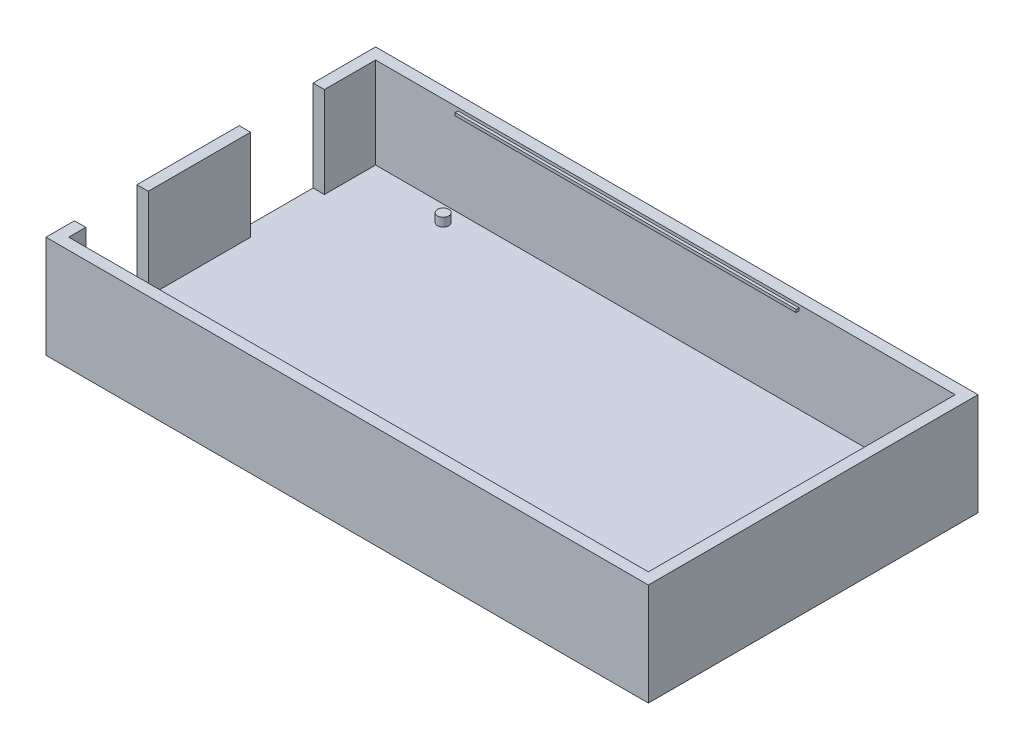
ISO-10303-21;
HEADER;
FILE_DESCRIPTION(('STEP AP214'),'2;1');
FILE_NAME('part.step','',(''),(''),'','','');
FILE_SCHEMA(('AUTOMOTIVE_DESIGN { 1 0 10303 214 1 1 1 1 }'));
ENDSEC;
DATA;
#1=APPLICATION_CONTEXT('core data for automotive mechanical design processes');
#2=APPLICATION_PROTOCOL_DEFINITION('international standard','automotive_design',2000,#1);
#3=PRODUCT_CONTEXT('',#1,'mechanical');
#4=PRODUCT('Part','Part','',(#3));
#5=PRODUCT_RELATED_PRODUCT_CATEGORY('part','',(#4));
#6=PRODUCT_DEFINITION_FORMATION('','',#4);
#7=PRODUCT_DEFINITION_CONTEXT('part definition',#1,'design');
#8=PRODUCT_DEFINITION('design','',#6,#7);
#9=PRODUCT_DEFINITION_SHAPE('','',#8);
#10=(LENGTH_UNIT() NAMED_UNIT(*) SI_UNIT(.MILLI.,.METRE.));
#11=(NAMED_UNIT(*) PLANE_ANGLE_UNIT() SI_UNIT($,.RADIAN.));
#12=(NAMED_UNIT(*) SI_UNIT($,.STERADIAN.) SOLID_ANGLE_UNIT());
#13=UNCERTAINTY_MEASURE_WITH_UNIT(LENGTH_MEASURE(1.E-05),#10,'distance_accuracy_value','');
#14=(GEOMETRIC_REPRESENTATION_CONTEXT(3) GLOBAL_UNCERTAINTY_ASSIGNED_CONTEXT((#13)) GLOBAL_UNIT_ASSIGNED_CONTEXT((#10,
#11,#12)) REPRESENTATION_CONTEXT('',''));
#15=CARTESIAN_POINT('',(0.,0.,0.));
#16=DIRECTION('',(0.,0.,1.));
#17=DIRECTION('',(1.,0.,0.));
#18=AXIS2_PLACEMENT_3D('',#15,#16,#17);
#19=CARTESIAN_POINT('',(0.,18.,-2.));
#20=DIRECTION('',(0.,0.,-1.));
#21=DIRECTION('',(-1.,0.,0.));
#22=AXIS2_PLACEMENT_3D('',#19,#20,#21);
#23=PLANE('',#22);
#24=DIRECTION('',(1.,0.,0.));
#25=VECTOR('',#24,1.);
#26=CARTESIAN_POINT('',(0.,2.,-2.));
#27=LINE('',#26,#25);
#28=CARTESIAN_POINT('',(2.,2.,-2.));
#29=VERTEX_POINT('',#28);
#30=CARTESIAN_POINT('',(104.,2.,-2.));
#31=VERTEX_POINT('',#30);
#32=EDGE_CURVE('E301',#29,#31,#27,.T.);
#33=ORIENTED_EDGE('',*,*,#32,.F.);
#34=DIRECTION('',(0.,-1.,0.));
#35=VECTOR('',#34,1.);
#36=CARTESIAN_POINT('',(2.,18.,-2.));
#37=LINE('',#36,#35);
#38=CARTESIAN_POINT('',(2.,18.,-2.));
#39=VERTEX_POINT('',#38);
#40=EDGE_CURVE('E303',#39,#29,#37,.T.);
#41=ORIENTED_EDGE('',*,*,#40,.F.);
#42=DIRECTION('',(1.,0.,0.));
#43=VECTOR('',#42,1.);
#44=CARTESIAN_POINT('',(0.,18.,-2.));
#45=LINE('',#44,#43);
#46=CARTESIAN_POINT('',(104.,18.,-2.));
#47=VERTEX_POINT('',#46);
#48=EDGE_CURVE('E326',#39,#47,#45,.T.);
#49=ORIENTED_EDGE('',*,*,#48,.T.);
#50=DIRECTION('',(0.,-1.,0.));
#51=VECTOR('',#50,1.);
#52=CARTESIAN_POINT('',(104.,18.,-2.));
#53=LINE('',#52,#51);
#54=EDGE_CURVE('E307',#47,#31,#53,.T.);
#55=ORIENTED_EDGE('',*,*,#54,.T.);
#56=EDGE_LOOP('',(#33,#41,#49,#55));
#57=FACE_BOUND('',#56,.T.);
#58=DIRECTION('',(-1.,0.,0.));
#59=VECTOR('',#58,1.);
#60=CARTESIAN_POINT('',(89.5,17.,-2.));
#61=LINE('',#60,#59);
#62=CARTESIAN_POINT('',(89.5,17.,-2.));
#63=VERTEX_POINT('',#62);
#64=CARTESIAN_POINT('',(29.5,17.,-2.));
#65=VERTEX_POINT('',#64);
#66=EDGE_CURVE('E788',#63,#65,#61,.T.);
#67=ORIENTED_EDGE('',*,*,#66,.F.);
#68=DIRECTION('',(0.,-1.,0.));
#69=VECTOR('',#68,1.);
#70=CARTESIAN_POINT('',(89.5,17.5,-2.));
#71=LINE('',#70,#69);
#72=CARTESIAN_POINT('',(89.5,17.5,-2.));
#73=VERTEX_POINT('',#72);
#74=EDGE_CURVE('E218',#73,#63,#71,.T.);
#75=ORIENTED_EDGE('',*,*,#74,.F.);
#76=DIRECTION('',(1.,0.,0.));
#77=VECTOR('',#76,1.);
#78=CARTESIAN_POINT('',(89.5,17.5,-2.));
#79=LINE('',#78,#77);
#80=CARTESIAN_POINT('',(29.5,17.5,-2.));
#81=VERTEX_POINT('',#80);
#82=EDGE_CURVE('E214',#81,#73,#79,.T.);
#83=ORIENTED_EDGE('',*,*,#82,.F.);
#84=DIRECTION('',(0.,1.,0.));
#85=VECTOR('',#84,1.);
#86=CARTESIAN_POINT('',(29.5,17.5,-2.));
#87=LINE('',#86,#85);
#88=EDGE_CURVE('E790',#65,#81,#87,.T.);
#89=ORIENTED_EDGE('',*,*,#88,.F.);
#90=EDGE_LOOP('',(#67,#75,#83,#89));
#91=FACE_BOUND('',#90,.T.);
#92=ADVANCED_FACE('F33',(#57,#91),#23,.T.);
#93=CARTESIAN_POINT('',(0.,18.,-56.));
#94=DIRECTION('',(0.,0.,1.));
#95=DIRECTION('',(1.,0.,0.));
#96=AXIS2_PLACEMENT_3D('',#93,#94,#95);
#97=PLANE('',#96);
#98=DIRECTION('',(-1.,0.,0.));
#99=VECTOR('',#98,1.);
#100=CARTESIAN_POINT('',(0.,2.,-56.));
#101=LINE('',#100,#99);
#102=CARTESIAN_POINT('',(104.,2.,-56.));
#103=VERTEX_POINT('',#102);
#104=CARTESIAN_POINT('',(2.,2.,-56.));
#105=VERTEX_POINT('',#104);
#106=EDGE_CURVE('E318',#103,#105,#101,.T.);
#107=ORIENTED_EDGE('',*,*,#106,.F.);
#108=DIRECTION('',(0.,-1.,0.));
#109=VECTOR('',#108,1.);
#110=CARTESIAN_POINT('',(104.,18.,-56.));
#111=LINE('',#110,#109);
#112=CARTESIAN_POINT('',(104.,18.,-56.));
#113=VERTEX_POINT('',#112);
#114=EDGE_CURVE('E311',#113,#103,#111,.T.);
#115=ORIENTED_EDGE('',*,*,#114,.F.);
#116=DIRECTION('',(-1.,0.,0.));
#117=VECTOR('',#116,1.);
#118=CARTESIAN_POINT('',(0.,18.,-56.));
#119=LINE('',#118,#117);
#120=CARTESIAN_POINT('',(2.,18.,-56.));
#121=VERTEX_POINT('',#120);
#122=EDGE_CURVE('E312',#113,#121,#119,.T.);
#123=ORIENTED_EDGE('',*,*,#122,.T.);
#124=DIRECTION('',(0.,-1.,0.));
#125=VECTOR('',#124,1.);
#126=CARTESIAN_POINT('',(2.,18.,-56.));
#127=LINE('',#126,#125);
#128=EDGE_CURVE('E308',#121,#105,#127,.T.);
#129=ORIENTED_EDGE('',*,*,#128,.T.);
#130=EDGE_LOOP('',(#107,#115,#123,#129));
#131=FACE_BOUND('',#130,.T.);
#132=DIRECTION('',(1.,0.,0.));
#133=VECTOR('',#132,1.);
#134=CARTESIAN_POINT('',(16.5,17.,-56.));
#135=LINE('',#134,#133);
#136=CARTESIAN_POINT('',(16.5,17.,-56.));
#137=VERTEX_POINT('',#136);
#138=CARTESIAN_POINT('',(76.5,17.,-56.));
#139=VERTEX_POINT('',#138);
#140=EDGE_CURVE('E223',#137,#139,#135,.T.);
#141=ORIENTED_EDGE('',*,*,#140,.F.);
#142=DIRECTION('',(0.,-1.,0.));
#143=VECTOR('',#142,1.);
#144=CARTESIAN_POINT('',(16.5,17.5,-56.));
#145=LINE('',#144,#143);
#146=CARTESIAN_POINT('',(16.5,17.5,-56.));
#147=VERTEX_POINT('',#146);
#148=EDGE_CURVE('E220',#147,#137,#145,.T.);
#149=ORIENTED_EDGE('',*,*,#148,.F.);
#150=DIRECTION('',(-1.,0.,0.));
#151=VECTOR('',#150,1.);
#152=CARTESIAN_POINT('',(16.5,17.5,-56.));
#153=LINE('',#152,#151);
#154=CARTESIAN_POINT('',(76.5,17.5,-56.));
#155=VERTEX_POINT('',#154);
#156=EDGE_CURVE('E232',#155,#147,#153,.T.);
#157=ORIENTED_EDGE('',*,*,#156,.F.);
#158=DIRECTION('',(0.,1.,0.));
#159=VECTOR('',#158,1.);
#160=CARTESIAN_POINT('',(76.5,17.5,-56.));
#161=LINE('',#160,#159);
#162=EDGE_CURVE('E240',#139,#155,#161,.T.);
#163=ORIENTED_EDGE('',*,*,#162,.F.);
#164=EDGE_LOOP('',(#141,#149,#157,#163));
#165=FACE_BOUND('',#164,.T.);
#166=ADVANCED_FACE('F462',(#131,#165),#97,.T.);
#167=CARTESIAN_POINT('',(2.,18.,0.));
#168=DIRECTION('',(1.,0.,0.));
#169=DIRECTION('',(0.,0.,-1.));
#170=AXIS2_PLACEMENT_3D('',#167,#168,#169);
#171=PLANE('',#170);
#172=DIRECTION('',(0.,1.,0.));
#173=VECTOR('',#172,1.);
#174=CARTESIAN_POINT('',(2.,2.,-5.));
#175=LINE('',#174,#173);
#176=CARTESIAN_POINT('',(2.,2.,-5.));
#177=VERTEX_POINT('',#176);
#178=CARTESIAN_POINT('',(2.,18.,-5.));
#179=VERTEX_POINT('',#178);
#180=EDGE_CURVE('E266',#177,#179,#175,.T.);
#181=ORIENTED_EDGE('',*,*,#180,.T.);
#182=DIRECTION('',(0.,0.,1.));
#183=VECTOR('',#182,1.);
#184=CARTESIAN_POINT('',(2.,18.,0.));
#185=LINE('',#184,#183);
#186=EDGE_CURVE('E322',#179,#39,#185,.T.);
#187=ORIENTED_EDGE('',*,*,#186,.T.);
#188=ORIENTED_EDGE('',*,*,#40,.T.);
#189=DIRECTION('',(0.,0.,1.));
#190=VECTOR('',#189,1.);
#191=CARTESIAN_POINT('',(2.,2.,0.));
#192=LINE('',#191,#190);
#193=EDGE_CURVE('E282',#177,#29,#192,.T.);
#194=ORIENTED_EDGE('',*,*,#193,.F.);
#195=EDGE_LOOP('',(#181,#187,#188,#194));
#196=FACE_BOUND('',#195,.T.);
#197=ADVANCED_FACE('F426',(#196),#171,.T.);
#198=CARTESIAN_POINT('',(0.,18.,0.));
#199=DIRECTION('',(0.,-1.,0.));
#200=DIRECTION('',(0.,0.,-1.));
#201=AXIS2_PLACEMENT_3D('',#198,#199,#200);
#202=PLANE('',#201);
#203=ORIENTED_EDGE('',*,*,#186,.F.);
#204=DIRECTION('',(-1.,0.,0.));
#205=VECTOR('',#204,1.);
#206=CARTESIAN_POINT('',(106.001,18.,-5.));
#207=LINE('',#206,#205);
#208=CARTESIAN_POINT('',(0.,18.,-5.));
#209=VERTEX_POINT('',#208);
#210=EDGE_CURVE('E269',#179,#209,#207,.T.);
#211=ORIENTED_EDGE('',*,*,#210,.T.);
#212=DIRECTION('',(0.,0.,1.));
#213=VECTOR('',#212,1.);
#214=CARTESIAN_POINT('',(0.,18.,0.));
#215=LINE('',#214,#213);
#216=CARTESIAN_POINT('',(0.,18.,0.));
#217=VERTEX_POINT('',#216);
#218=EDGE_CURVE('E338',#209,#217,#215,.T.);
#219=ORIENTED_EDGE('',*,*,#218,.T.);
#220=DIRECTION('',(1.,0.,0.));
#221=VECTOR('',#220,1.);
#222=CARTESIAN_POINT('',(0.,18.,0.));
#223=LINE('',#222,#221);
#224=CARTESIAN_POINT('',(106.,18.,0.));
#225=VERTEX_POINT('',#224);
#226=EDGE_CURVE('E336',#217,#225,#223,.T.);
#227=ORIENTED_EDGE('',*,*,#226,.T.);
#228=DIRECTION('',(0.,0.,-1.));
#229=VECTOR('',#228,1.);
#230=CARTESIAN_POINT('',(106.,18.,0.));
#231=LINE('',#230,#229);
#232=CARTESIAN_POINT('',(106.,18.,-58.));
#233=VERTEX_POINT('',#232);
#234=EDGE_CURVE('E340',#225,#233,#231,.T.);
#235=ORIENTED_EDGE('',*,*,#234,.T.);
#236=DIRECTION('',(-1.,0.,0.));
#237=VECTOR('',#236,1.);
#238=CARTESIAN_POINT('',(0.,18.,-58.));
#239=LINE('',#238,#237);
#240=CARTESIAN_POINT('',(0.,18.,-58.));
#241=VERTEX_POINT('',#240);
#242=EDGE_CURVE('E342',#233,#241,#239,.T.);
#243=ORIENTED_EDGE('',*,*,#242,.T.);
#244=CARTESIAN_POINT('',(0.,18.,-47.));
#245=VERTEX_POINT('',#244);
#246=EDGE_CURVE('E333',#241,#245,#215,.T.);
#247=ORIENTED_EDGE('',*,*,#246,.T.);
#248=DIRECTION('',(-1.,0.,0.));
#249=VECTOR('',#248,1.);
#250=CARTESIAN_POINT('',(106.001,18.,-47.));
#251=LINE('',#250,#249);
#252=CARTESIAN_POINT('',(2.,18.,-47.));
#253=VERTEX_POINT('',#252);
#254=EDGE_CURVE('E259',#253,#245,#251,.T.);
#255=ORIENTED_EDGE('',*,*,#254,.F.);
#256=EDGE_CURVE('E323',#121,#253,#185,.T.);
#257=ORIENTED_EDGE('',*,*,#256,.F.);
#258=ORIENTED_EDGE('',*,*,#122,.F.);
#259=DIRECTION('',(0.,0.,-1.));
#260=VECTOR('',#259,1.);
#261=CARTESIAN_POINT('',(104.,18.,0.));
#262=LINE('',#261,#260);
#263=EDGE_CURVE('E329',#47,#113,#262,.T.);
#264=ORIENTED_EDGE('',*,*,#263,.F.);
#265=ORIENTED_EDGE('',*,*,#48,.F.);
#266=EDGE_LOOP('',(#203,#211,#219,#227,#235,#243,#247,#255,#257,#258,#264,#265));
#267=FACE_BOUND('',#266,.T.);
#268=ADVANCED_FACE('F397',(#267),#202,.F.);
#269=DIRECTION('',(0.,-1.,0.));
#270=VECTOR('',#269,1.);
#271=CARTESIAN_POINT('',(2.,18.,-16.));
#272=LINE('',#271,#270);
#273=CARTESIAN_POINT('',(2.,18.,-16.));
#274=VERTEX_POINT('',#273);
#275=CARTESIAN_POINT('',(2.,2.,-16.));
#276=VERTEX_POINT('',#275);
#277=EDGE_CURVE('E252',#274,#276,#272,.T.);
#278=ORIENTED_EDGE('',*,*,#277,.T.);
#279=CARTESIAN_POINT('',(2.,2.,-34.));
#280=VERTEX_POINT('',#279);
#281=EDGE_CURVE('E302',#280,#276,#192,.T.);
#282=ORIENTED_EDGE('',*,*,#281,.F.);
#283=DIRECTION('',(0.,1.,0.));
#284=VECTOR('',#283,1.);
#285=CARTESIAN_POINT('',(2.,2.,-34.));
#286=LINE('',#285,#284);
#287=CARTESIAN_POINT('',(2.,18.,-34.));
#288=VERTEX_POINT('',#287);
#289=EDGE_CURVE('E289',#280,#288,#286,.T.);
#290=ORIENTED_EDGE('',*,*,#289,.T.);
#291=EDGE_CURVE('E327',#288,#274,#185,.T.);
#292=ORIENTED_EDGE('',*,*,#291,.T.);
#293=EDGE_LOOP('',(#278,#282,#290,#292));
#294=FACE_BOUND('',#293,.T.);
#295=ADVANCED_FACE('F415',(#294),#171,.T.);
#296=CARTESIAN_POINT('',(0.,18.,-34.));
#297=VERTEX_POINT('',#296);
#298=CARTESIAN_POINT('',(0.,18.,-16.));
#299=VERTEX_POINT('',#298);
#300=EDGE_CURVE('E337',#297,#299,#215,.T.);
#301=ORIENTED_EDGE('',*,*,#300,.T.);
#302=DIRECTION('',(-1.,0.,0.));
#303=VECTOR('',#302,1.);
#304=CARTESIAN_POINT('',(106.001,18.,-16.));
#305=LINE('',#304,#303);
#306=EDGE_CURVE('E251',#274,#299,#305,.T.);
#307=ORIENTED_EDGE('',*,*,#306,.F.);
#308=ORIENTED_EDGE('',*,*,#291,.F.);
#309=DIRECTION('',(-1.,0.,0.));
#310=VECTOR('',#309,1.);
#311=CARTESIAN_POINT('',(106.001,18.,-34.));
#312=LINE('',#311,#310);
#313=EDGE_CURVE('E292',#288,#297,#312,.T.);
#314=ORIENTED_EDGE('',*,*,#313,.T.);
#315=EDGE_LOOP('',(#301,#307,#308,#314));
#316=FACE_BOUND('',#315,.T.);
#317=ADVANCED_FACE('F430',(#316),#202,.F.);
#318=CARTESIAN_POINT('',(0.,18.,0.));
#319=DIRECTION('',(1.,0.,0.));
#320=DIRECTION('',(0.,0.,-1.));
#321=AXIS2_PLACEMENT_3D('',#318,#319,#320);
#322=PLANE('',#321);
#323=ORIENTED_EDGE('',*,*,#218,.F.);
#324=DIRECTION('',(0.,1.,0.));
#325=VECTOR('',#324,1.);
#326=CARTESIAN_POINT('',(0.,2.,-5.));
#327=LINE('',#326,#325);
#328=CARTESIAN_POINT('',(0.,2.,-5.));
#329=VERTEX_POINT('',#328);
#330=EDGE_CURVE('E257',#329,#209,#327,.T.);
#331=ORIENTED_EDGE('',*,*,#330,.F.);
#332=DIRECTION('',(0.,0.,1.));
#333=VECTOR('',#332,1.);
#334=CARTESIAN_POINT('',(0.,2.,-16.));
#335=LINE('',#334,#333);
#336=CARTESIAN_POINT('',(0.,2.,-16.));
#337=VERTEX_POINT('',#336);
#338=EDGE_CURVE('E260',#337,#329,#335,.T.);
#339=ORIENTED_EDGE('',*,*,#338,.F.);
#340=DIRECTION('',(0.,-1.,0.));
#341=VECTOR('',#340,1.);
#342=CARTESIAN_POINT('',(0.,18.,-16.));
#343=LINE('',#342,#341);
#344=EDGE_CURVE('E263',#299,#337,#343,.T.);
#345=ORIENTED_EDGE('',*,*,#344,.F.);
#346=ORIENTED_EDGE('',*,*,#300,.F.);
#347=DIRECTION('',(0.,1.,0.));
#348=VECTOR('',#347,1.);
#349=CARTESIAN_POINT('',(0.,2.,-34.));
#350=LINE('',#349,#348);
#351=CARTESIAN_POINT('',(0.,2.,-34.));
#352=VERTEX_POINT('',#351);
#353=EDGE_CURVE('E280',#352,#297,#350,.T.);
#354=ORIENTED_EDGE('',*,*,#353,.F.);
#355=DIRECTION('',(0.,0.,1.));
#356=VECTOR('',#355,1.);
#357=CARTESIAN_POINT('',(0.,2.,-47.));
#358=LINE('',#357,#356);
#359=CARTESIAN_POINT('',(0.,2.,-47.));
#360=VERTEX_POINT('',#359);
#361=EDGE_CURVE('E283',#360,#352,#358,.T.);
#362=ORIENTED_EDGE('',*,*,#361,.F.);
#363=DIRECTION('',(0.,-1.,0.));
#364=VECTOR('',#363,1.);
#365=CARTESIAN_POINT('',(0.,18.,-47.));
#366=LINE('',#365,#364);
#367=EDGE_CURVE('E286',#245,#360,#366,.T.);
#368=ORIENTED_EDGE('',*,*,#367,.F.);
#369=ORIENTED_EDGE('',*,*,#246,.F.);
#370=DIRECTION('',(0.,-1.,0.));
#371=VECTOR('',#370,1.);
#372=CARTESIAN_POINT('',(0.,18.,-58.));
#373=LINE('',#372,#371);
#374=CARTESIAN_POINT('',(0.,0.,-58.));
#375=VERTEX_POINT('',#374);
#376=EDGE_CURVE('E344',#241,#375,#373,.T.);
#377=ORIENTED_EDGE('',*,*,#376,.T.);
#378=DIRECTION('',(0.,0.,1.));
#379=VECTOR('',#378,1.);
#380=CARTESIAN_POINT('',(0.,0.,0.));
#381=LINE('',#380,#379);
#382=CARTESIAN_POINT('',(0.,0.,0.));
#383=VERTEX_POINT('',#382);
#384=EDGE_CURVE('E306',#375,#383,#381,.T.);
#385=ORIENTED_EDGE('',*,*,#384,.T.);
#386=DIRECTION('',(0.,-1.,0.));
#387=VECTOR('',#386,1.);
#388=CARTESIAN_POINT('',(0.,18.,0.));
#389=LINE('',#388,#387);
#390=EDGE_CURVE('E361',#217,#383,#389,.T.);
#391=ORIENTED_EDGE('',*,*,#390,.F.);
#392=EDGE_LOOP('',(#323,#331,#339,#345,#346,#354,#362,#368,#369,#377,#385,#391));
#393=FACE_BOUND('',#392,.T.);
#394=ADVANCED_FACE('F35',(#393),#322,.F.);
#395=CARTESIAN_POINT('',(0.,18.,0.));
#396=DIRECTION('',(0.,0.,-1.));
#397=DIRECTION('',(-1.,0.,0.));
#398=AXIS2_PLACEMENT_3D('',#395,#396,#397);
#399=PLANE('',#398);
#400=DIRECTION('',(1.,0.,0.));
#401=VECTOR('',#400,1.);
#402=CARTESIAN_POINT('',(0.,0.,0.));
#403=LINE('',#402,#401);
#404=CARTESIAN_POINT('',(106.,0.,0.));
#405=VERTEX_POINT('',#404);
#406=EDGE_CURVE('E347',#383,#405,#403,.T.);
#407=ORIENTED_EDGE('',*,*,#406,.T.);
#408=DIRECTION('',(0.,-1.,0.));
#409=VECTOR('',#408,1.);
#410=CARTESIAN_POINT('',(106.,18.,0.));
#411=LINE('',#410,#409);
#412=EDGE_CURVE('E358',#225,#405,#411,.T.);
#413=ORIENTED_EDGE('',*,*,#412,.F.);
#414=ORIENTED_EDGE('',*,*,#226,.F.);
#415=ORIENTED_EDGE('',*,*,#390,.T.);
#416=EDGE_LOOP('',(#407,#413,#414,#415));
#417=FACE_BOUND('',#416,.T.);
#418=ADVANCED_FACE('F442',(#417),#399,.F.);
#419=CARTESIAN_POINT('',(106.,18.,0.));
#420=DIRECTION('',(-1.,0.,0.));
#421=DIRECTION('',(0.,0.,1.));
#422=AXIS2_PLACEMENT_3D('',#419,#420,#421);
#423=PLANE('',#422);
#424=DIRECTION('',(0.,0.,-1.));
#425=VECTOR('',#424,1.);
#426=CARTESIAN_POINT('',(106.,0.,0.));
#427=LINE('',#426,#425);
#428=CARTESIAN_POINT('',(106.,0.,-58.));
#429=VERTEX_POINT('',#428);
#430=EDGE_CURVE('E349',#405,#429,#427,.T.);
#431=ORIENTED_EDGE('',*,*,#430,.T.);
#432=DIRECTION('',(0.,-1.,0.));
#433=VECTOR('',#432,1.);
#434=CARTESIAN_POINT('',(106.,18.,-58.));
#435=LINE('',#434,#433);
#436=EDGE_CURVE('E355',#233,#429,#435,.T.);
#437=ORIENTED_EDGE('',*,*,#436,.F.);
#438=ORIENTED_EDGE('',*,*,#234,.F.);
#439=ORIENTED_EDGE('',*,*,#412,.T.);
#440=EDGE_LOOP('',(#431,#437,#438,#439));
#441=FACE_BOUND('',#440,.T.);
#442=ADVANCED_FACE('F449',(#441),#423,.F.);
#443=CARTESIAN_POINT('',(0.,18.,-58.));
#444=DIRECTION('',(0.,0.,1.));
#445=DIRECTION('',(1.,0.,0.));
#446=AXIS2_PLACEMENT_3D('',#443,#444,#445);
#447=PLANE('',#446);
#448=DIRECTION('',(-1.,0.,0.));
#449=VECTOR('',#448,1.);
#450=CARTESIAN_POINT('',(0.,0.,-58.));
#451=LINE('',#450,#449);
#452=EDGE_CURVE('E351',#429,#375,#451,.T.);
#453=ORIENTED_EDGE('',*,*,#452,.T.);
#454=ORIENTED_EDGE('',*,*,#376,.F.);
#455=ORIENTED_EDGE('',*,*,#242,.F.);
#456=ORIENTED_EDGE('',*,*,#436,.T.);
#457=EDGE_LOOP('',(#453,#454,#455,#456));
#458=FACE_BOUND('',#457,.T.);
#459=ADVANCED_FACE('F452',(#458),#447,.F.);
#460=CARTESIAN_POINT('',(0.,0.,0.));
#461=DIRECTION('',(0.,-1.,0.));
#462=DIRECTION('',(0.,0.,-1.));
#463=AXIS2_PLACEMENT_3D('',#460,#461,#462);
#464=PLANE('',#463);
#465=ORIENTED_EDGE('',*,*,#384,.F.);
#466=ORIENTED_EDGE('',*,*,#452,.F.);
#467=ORIENTED_EDGE('',*,*,#430,.F.);
#468=ORIENTED_EDGE('',*,*,#406,.F.);
#469=EDGE_LOOP('',(#465,#466,#467,#468));
#470=FACE_BOUND('',#469,.T.);
#471=ADVANCED_FACE('F446',(#470),#464,.T.);
#472=DIRECTION('',(0.,-1.,0.));
#473=VECTOR('',#472,1.);
#474=CARTESIAN_POINT('',(2.,18.,-47.));
#475=LINE('',#474,#473);
#476=CARTESIAN_POINT('',(2.,2.,-47.));
#477=VERTEX_POINT('',#476);
#478=EDGE_CURVE('E275',#253,#477,#475,.T.);
#479=ORIENTED_EDGE('',*,*,#478,.T.);
#480=EDGE_CURVE('E298',#105,#477,#192,.T.);
#481=ORIENTED_EDGE('',*,*,#480,.F.);
#482=ORIENTED_EDGE('',*,*,#128,.F.);
#483=ORIENTED_EDGE('',*,*,#256,.T.);
#484=EDGE_LOOP('',(#479,#481,#482,#483));
#485=FACE_BOUND('',#484,.T.);
#486=ADVANCED_FACE('F389',(#485),#171,.T.);
#487=CARTESIAN_POINT('',(104.,18.,0.));
#488=DIRECTION('',(-1.,0.,0.));
#489=DIRECTION('',(0.,0.,1.));
#490=AXIS2_PLACEMENT_3D('',#487,#488,#489);
#491=PLANE('',#490);
#492=DIRECTION('',(0.,0.,-1.));
#493=VECTOR('',#492,1.);
#494=CARTESIAN_POINT('',(104.,2.,0.));
#495=LINE('',#494,#493);
#496=EDGE_CURVE('E314',#31,#103,#495,.T.);
#497=ORIENTED_EDGE('',*,*,#496,.F.);
#498=ORIENTED_EDGE('',*,*,#54,.F.);
#499=ORIENTED_EDGE('',*,*,#263,.T.);
#500=ORIENTED_EDGE('',*,*,#114,.T.);
#501=EDGE_LOOP('',(#497,#498,#499,#500));
#502=FACE_BOUND('',#501,.T.);
#503=ADVANCED_FACE('F378',(#502),#491,.T.);
#504=CARTESIAN_POINT('',(0.,2.,0.));
#505=DIRECTION('',(0.,-1.,0.));
#506=DIRECTION('',(0.,0.,-1.));
#507=AXIS2_PLACEMENT_3D('',#504,#505,#506);
#508=PLANE('',#507);
#509=CARTESIAN_POINT('',(15.4299351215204,2.,-4.92757844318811));
#510=DIRECTION('',(0.,-1.,0.));
#511=DIRECTION('',(0.,0.,-1.));
#512=AXIS2_PLACEMENT_3D('',#509,#510,#511);
#513=CIRCLE('',#512,1.);
#514=CARTESIAN_POINT('',(15.4299351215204,2.,-5.92757844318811));
#515=VERTEX_POINT('',#514);
#516=EDGE_CURVE('E11',#515,#515,#513,.F.);
#517=ORIENTED_EDGE('',*,*,#516,.F.);
#518=EDGE_LOOP('',(#517));
#519=FACE_BOUND('',#518,.T.);
#520=CARTESIAN_POINT('',(97.9799351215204,2.,-4.92757844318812));
#521=DIRECTION('',(0.,-1.,0.));
#522=DIRECTION('',(0.,0.,-1.));
#523=AXIS2_PLACEMENT_3D('',#520,#521,#522);
#524=CIRCLE('',#523,0.999999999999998);
#525=CARTESIAN_POINT('',(97.9799351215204,2.,-5.92757844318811));
#526=VERTEX_POINT('',#525);
#527=EDGE_CURVE('E41',#526,#526,#524,.F.);
#528=ORIENTED_EDGE('',*,*,#527,.F.);
#529=EDGE_LOOP('',(#528));
#530=FACE_BOUND('',#529,.T.);
#531=CARTESIAN_POINT('',(91.6299351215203,2.,-53.1875784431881));
#532=DIRECTION('',(0.,-1.,0.));
#533=DIRECTION('',(0.,0.,-1.));
#534=AXIS2_PLACEMENT_3D('',#531,#532,#533);
#535=CIRCLE('',#534,0.999999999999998);
#536=CARTESIAN_POINT('',(91.6299351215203,2.,-54.1875784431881));
#537=VERTEX_POINT('',#536);
#538=EDGE_CURVE('E367',#537,#537,#535,.F.);
#539=ORIENTED_EDGE('',*,*,#538,.F.);
#540=EDGE_LOOP('',(#539));
#541=FACE_BOUND('',#540,.T.);
#542=CARTESIAN_POINT('',(16.6999351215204,2.,-53.1875784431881));
#543=DIRECTION('',(0.,-1.,0.));
#544=DIRECTION('',(0.,0.,-1.));
#545=AXIS2_PLACEMENT_3D('',#542,#543,#544);
#546=CIRCLE('',#545,1.);
#547=CARTESIAN_POINT('',(16.6999351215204,2.,-54.1875784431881));
#548=VERTEX_POINT('',#547);
#549=EDGE_CURVE('E364',#548,#548,#546,.F.);
#550=ORIENTED_EDGE('',*,*,#549,.F.);
#551=EDGE_LOOP('',(#550));
#552=FACE_BOUND('',#551,.T.);
#553=ORIENTED_EDGE('',*,*,#480,.T.);
#554=DIRECTION('',(-1.,0.,0.));
#555=VECTOR('',#554,1.);
#556=CARTESIAN_POINT('',(106.001,2.,-47.));
#557=LINE('',#556,#555);
#558=EDGE_CURVE('E278',#477,#360,#557,.T.);
#559=ORIENTED_EDGE('',*,*,#558,.T.);
#560=ORIENTED_EDGE('',*,*,#361,.T.);
#561=DIRECTION('',(-1.,0.,0.));
#562=VECTOR('',#561,1.);
#563=CARTESIAN_POINT('',(106.001,2.,-34.));
#564=LINE('',#563,#562);
#565=EDGE_CURVE('E279',#280,#352,#564,.T.);
#566=ORIENTED_EDGE('',*,*,#565,.F.);
#567=ORIENTED_EDGE('',*,*,#281,.T.);
#568=DIRECTION('',(-1.,0.,0.));
#569=VECTOR('',#568,1.);
#570=CARTESIAN_POINT('',(106.001,2.,-16.));
#571=LINE('',#570,#569);
#572=EDGE_CURVE('E255',#276,#337,#571,.T.);
#573=ORIENTED_EDGE('',*,*,#572,.T.);
#574=ORIENTED_EDGE('',*,*,#338,.T.);
#575=DIRECTION('',(-1.,0.,0.));
#576=VECTOR('',#575,1.);
#577=CARTESIAN_POINT('',(106.001,2.,-5.));
#578=LINE('',#577,#576);
#579=EDGE_CURVE('E256',#177,#329,#578,.T.);
#580=ORIENTED_EDGE('',*,*,#579,.F.);
#581=ORIENTED_EDGE('',*,*,#193,.T.);
#582=ORIENTED_EDGE('',*,*,#32,.T.);
#583=ORIENTED_EDGE('',*,*,#496,.T.);
#584=ORIENTED_EDGE('',*,*,#106,.T.);
#585=EDGE_LOOP('',(#553,#559,#560,#566,#567,#573,#574,#580,#581,#582,#583,#584));
#586=FACE_BOUND('',#585,.T.);
#587=ADVANCED_FACE('F374',(#519,#530,#541,#552,#586),#508,.F.);
#588=CARTESIAN_POINT('',(106.001,2.,-34.));
#589=DIRECTION('',(0.,0.,1.));
#590=DIRECTION('',(1.,0.,0.));
#591=AXIS2_PLACEMENT_3D('',#588,#589,#590);
#592=PLANE('',#591);
#593=ORIENTED_EDGE('',*,*,#565,.T.);
#594=ORIENTED_EDGE('',*,*,#353,.T.);
#595=ORIENTED_EDGE('',*,*,#313,.F.);
#596=ORIENTED_EDGE('',*,*,#289,.F.);
#597=EDGE_LOOP('',(#593,#594,#595,#596));
#598=FACE_BOUND('',#597,.T.);
#599=ADVANCED_FACE('F377',(#598),#592,.F.);
#600=CARTESIAN_POINT('',(106.001,18.,-47.));
#601=DIRECTION('',(0.,0.,-1.));
#602=DIRECTION('',(-1.,0.,0.));
#603=AXIS2_PLACEMENT_3D('',#600,#601,#602);
#604=PLANE('',#603);
#605=ORIENTED_EDGE('',*,*,#254,.T.);
#606=ORIENTED_EDGE('',*,*,#367,.T.);
#607=ORIENTED_EDGE('',*,*,#558,.F.);
#608=ORIENTED_EDGE('',*,*,#478,.F.);
#609=EDGE_LOOP('',(#605,#606,#607,#608));
#610=FACE_BOUND('',#609,.T.);
#611=ADVANCED_FACE('F393',(#610),#604,.F.);
#612=CARTESIAN_POINT('',(106.001,2.,-5.));
#613=DIRECTION('',(0.,0.,1.));
#614=DIRECTION('',(1.,0.,0.));
#615=AXIS2_PLACEMENT_3D('',#612,#613,#614);
#616=PLANE('',#615);
#617=ORIENTED_EDGE('',*,*,#579,.T.);
#618=ORIENTED_EDGE('',*,*,#330,.T.);
#619=ORIENTED_EDGE('',*,*,#210,.F.);
#620=ORIENTED_EDGE('',*,*,#180,.F.);
#621=EDGE_LOOP('',(#617,#618,#619,#620));
#622=FACE_BOUND('',#621,.T.);
#623=ADVANCED_FACE('F438',(#622),#616,.F.);
#624=CARTESIAN_POINT('',(106.001,18.,-16.));
#625=DIRECTION('',(0.,0.,-1.));
#626=DIRECTION('',(0.,1.,0.));
#627=AXIS2_PLACEMENT_3D('',#624,#625,#626);
#628=PLANE('',#627);
#629=ORIENTED_EDGE('',*,*,#306,.T.);
#630=ORIENTED_EDGE('',*,*,#344,.T.);
#631=ORIENTED_EDGE('',*,*,#572,.F.);
#632=ORIENTED_EDGE('',*,*,#277,.F.);
#633=EDGE_LOOP('',(#629,#630,#631,#632));
#634=FACE_BOUND('',#633,.T.);
#635=ADVANCED_FACE('F433',(#634),#628,.F.);
#636=CARTESIAN_POINT('',(16.5,17.5,-55.5));
#637=DIRECTION('',(1.,0.,0.));
#638=DIRECTION('',(0.,0.,-1.));
#639=AXIS2_PLACEMENT_3D('',#636,#637,#638);
#640=PLANE('',#639);
#641=ORIENTED_EDGE('',*,*,#148,.T.);
#642=DIRECTION('',(0.,0.,-1.));
#643=VECTOR('',#642,1.);
#644=CARTESIAN_POINT('',(16.5,17.,-55.5));
#645=LINE('',#644,#643);
#646=CARTESIAN_POINT('',(16.5,17.,-55.5));
#647=VERTEX_POINT('',#646);
#648=EDGE_CURVE('E249',#647,#137,#645,.T.);
#649=ORIENTED_EDGE('',*,*,#648,.F.);
#650=DIRECTION('',(0.,-1.,0.));
#651=VECTOR('',#650,1.);
#652=CARTESIAN_POINT('',(16.5,17.5,-55.5));
#653=LINE('',#652,#651);
#654=CARTESIAN_POINT('',(16.5,17.5,-55.5));
#655=VERTEX_POINT('',#654);
#656=EDGE_CURVE('E228',#655,#647,#653,.T.);
#657=ORIENTED_EDGE('',*,*,#656,.F.);
#658=DIRECTION('',(0.,0.,-1.));
#659=VECTOR('',#658,1.);
#660=CARTESIAN_POINT('',(16.5,17.5,-55.5));
#661=LINE('',#660,#659);
#662=EDGE_CURVE('E237',#655,#147,#661,.T.);
#663=ORIENTED_EDGE('',*,*,#662,.T.);
#664=EDGE_LOOP('',(#641,#649,#657,#663));
#665=FACE_BOUND('',#664,.T.);
#666=ADVANCED_FACE('F525',(#665),#640,.F.);
#667=CARTESIAN_POINT('',(16.5,17.,-55.5));
#668=DIRECTION('',(0.,1.,0.));
#669=DIRECTION('',(0.,0.,1.));
#670=AXIS2_PLACEMENT_3D('',#667,#668,#669);
#671=PLANE('',#670);
#672=ORIENTED_EDGE('',*,*,#140,.T.);
#673=DIRECTION('',(0.,0.,-1.));
#674=VECTOR('',#673,1.);
#675=CARTESIAN_POINT('',(76.5,17.,-55.5));
#676=LINE('',#675,#674);
#677=CARTESIAN_POINT('',(76.5,17.,-55.5));
#678=VERTEX_POINT('',#677);
#679=EDGE_CURVE('E246',#678,#139,#676,.T.);
#680=ORIENTED_EDGE('',*,*,#679,.F.);
#681=DIRECTION('',(1.,0.,0.));
#682=VECTOR('',#681,1.);
#683=CARTESIAN_POINT('',(16.5,17.,-55.5));
#684=LINE('',#683,#682);
#685=EDGE_CURVE('E231',#647,#678,#684,.T.);
#686=ORIENTED_EDGE('',*,*,#685,.F.);
#687=ORIENTED_EDGE('',*,*,#648,.T.);
#688=EDGE_LOOP('',(#672,#680,#686,#687));
#689=FACE_BOUND('',#688,.T.);
#690=ADVANCED_FACE('F533',(#689),#671,.F.);
#691=CARTESIAN_POINT('',(76.5,17.5,-55.5));
#692=DIRECTION('',(-1.,0.,0.));
#693=DIRECTION('',(0.,0.,1.));
#694=AXIS2_PLACEMENT_3D('',#691,#692,#693);
#695=PLANE('',#694);
#696=ORIENTED_EDGE('',*,*,#162,.T.);
#697=DIRECTION('',(0.,0.,-1.));
#698=VECTOR('',#697,1.);
#699=CARTESIAN_POINT('',(76.5,17.5,-55.5));
#700=LINE('',#699,#698);
#701=CARTESIAN_POINT('',(76.5,17.5,-55.5));
#702=VERTEX_POINT('',#701);
#703=EDGE_CURVE('E56',#702,#155,#700,.T.);
#704=ORIENTED_EDGE('',*,*,#703,.F.);
#705=DIRECTION('',(0.,1.,0.));
#706=VECTOR('',#705,1.);
#707=CARTESIAN_POINT('',(76.5,17.5,-55.5));
#708=LINE('',#707,#706);
#709=EDGE_CURVE('E234',#678,#702,#708,.T.);
#710=ORIENTED_EDGE('',*,*,#709,.F.);
#711=ORIENTED_EDGE('',*,*,#679,.T.);
#712=EDGE_LOOP('',(#696,#704,#710,#711));
#713=FACE_BOUND('',#712,.T.);
#714=ADVANCED_FACE('F541',(#713),#695,.F.);
#715=CARTESIAN_POINT('',(16.5,17.5,-55.5));
#716=DIRECTION('',(0.,-1.,0.));
#717=DIRECTION('',(0.,0.,-1.));
#718=AXIS2_PLACEMENT_3D('',#715,#716,#717);
#719=PLANE('',#718);
#720=ORIENTED_EDGE('',*,*,#156,.T.);
#721=ORIENTED_EDGE('',*,*,#662,.F.);
#722=DIRECTION('',(-1.,0.,0.));
#723=VECTOR('',#722,1.);
#724=CARTESIAN_POINT('',(16.5,17.5,-55.5));
#725=LINE('',#724,#723);
#726=EDGE_CURVE('E236',#702,#655,#725,.T.);
#727=ORIENTED_EDGE('',*,*,#726,.F.);
#728=ORIENTED_EDGE('',*,*,#703,.T.);
#729=EDGE_LOOP('',(#720,#721,#727,#728));
#730=FACE_BOUND('',#729,.T.);
#731=ADVANCED_FACE('F549',(#730),#719,.F.);
#732=CARTESIAN_POINT('',(0.,0.,-55.5));
#733=DIRECTION('',(0.,0.,1.));
#734=DIRECTION('',(1.,0.,0.));
#735=AXIS2_PLACEMENT_3D('',#732,#733,#734);
#736=PLANE('',#735);
#737=ORIENTED_EDGE('',*,*,#656,.T.);
#738=ORIENTED_EDGE('',*,*,#685,.T.);
#739=ORIENTED_EDGE('',*,*,#709,.T.);
#740=ORIENTED_EDGE('',*,*,#726,.T.);
#741=EDGE_LOOP('',(#737,#738,#739,#740));
#742=FACE_BOUND('',#741,.T.);
#743=ADVANCED_FACE('F557',(#742),#736,.T.);
#744=CARTESIAN_POINT('',(89.5,17.5,-2.5));
#745=DIRECTION('',(-1.,0.,0.));
#746=DIRECTION('',(0.,0.,1.));
#747=AXIS2_PLACEMENT_3D('',#744,#745,#746);
#748=PLANE('',#747);
#749=ORIENTED_EDGE('',*,*,#74,.T.);
#750=DIRECTION('',(0.,0.,1.));
#751=VECTOR('',#750,1.);
#752=CARTESIAN_POINT('',(89.5,17.,-2.5));
#753=LINE('',#752,#751);
#754=CARTESIAN_POINT('',(89.5,17.,-2.5));
#755=VERTEX_POINT('',#754);
#756=EDGE_CURVE('E199',#755,#63,#753,.T.);
#757=ORIENTED_EDGE('',*,*,#756,.F.);
#758=DIRECTION('',(0.,-1.,0.));
#759=VECTOR('',#758,1.);
#760=CARTESIAN_POINT('',(89.5,17.5,-2.5));
#761=LINE('',#760,#759);
#762=CARTESIAN_POINT('',(89.5,17.5,-2.5));
#763=VERTEX_POINT('',#762);
#764=EDGE_CURVE('E206',#763,#755,#761,.T.);
#765=ORIENTED_EDGE('',*,*,#764,.F.);
#766=DIRECTION('',(0.,0.,1.));
#767=VECTOR('',#766,1.);
#768=CARTESIAN_POINT('',(89.5,17.5,-2.5));
#769=LINE('',#768,#767);
#770=EDGE_CURVE('E786',#763,#73,#769,.T.);
#771=ORIENTED_EDGE('',*,*,#770,.T.);
#772=EDGE_LOOP('',(#749,#757,#765,#771));
#773=FACE_BOUND('',#772,.T.);
#774=ADVANCED_FACE('F216',(#773),#748,.F.);
#775=CARTESIAN_POINT('',(89.5,17.,-2.5));
#776=DIRECTION('',(0.,1.,0.));
#777=DIRECTION('',(0.,0.,1.));
#778=AXIS2_PLACEMENT_3D('',#775,#776,#777);
#779=PLANE('',#778);
#780=ORIENTED_EDGE('',*,*,#66,.T.);
#781=DIRECTION('',(0.,0.,1.));
#782=VECTOR('',#781,1.);
#783=CARTESIAN_POINT('',(29.5,17.,-2.5));
#784=LINE('',#783,#782);
#785=CARTESIAN_POINT('',(29.5,17.,-2.5));
#786=VERTEX_POINT('',#785);
#787=EDGE_CURVE('E202',#786,#65,#784,.T.);
#788=ORIENTED_EDGE('',*,*,#787,.F.);
#789=DIRECTION('',(-1.,0.,0.));
#790=VECTOR('',#789,1.);
#791=CARTESIAN_POINT('',(89.5,17.,-2.5));
#792=LINE('',#791,#790);
#793=EDGE_CURVE('E195',#755,#786,#792,.T.);
#794=ORIENTED_EDGE('',*,*,#793,.F.);
#795=ORIENTED_EDGE('',*,*,#756,.T.);
#796=EDGE_LOOP('',(#780,#788,#794,#795));
#797=FACE_BOUND('',#796,.T.);
#798=ADVANCED_FACE('F197',(#797),#779,.F.);
#799=CARTESIAN_POINT('',(29.5,17.5,-2.5));
#800=DIRECTION('',(1.,0.,0.));
#801=DIRECTION('',(0.,0.,-1.));
#802=AXIS2_PLACEMENT_3D('',#799,#800,#801);
#803=PLANE('',#802);
#804=ORIENTED_EDGE('',*,*,#88,.T.);
#805=DIRECTION('',(0.,0.,1.));
#806=VECTOR('',#805,1.);
#807=CARTESIAN_POINT('',(29.5,17.5,-2.5));
#808=LINE('',#807,#806);
#809=CARTESIAN_POINT('',(29.5,17.5,-2.5));
#810=VERTEX_POINT('',#809);
#811=EDGE_CURVE('E48',#810,#81,#808,.T.);
#812=ORIENTED_EDGE('',*,*,#811,.F.);
#813=DIRECTION('',(0.,1.,0.));
#814=VECTOR('',#813,1.);
#815=CARTESIAN_POINT('',(29.5,17.5,-2.5));
#816=LINE('',#815,#814);
#817=EDGE_CURVE('E205',#786,#810,#816,.T.);
#818=ORIENTED_EDGE('',*,*,#817,.F.);
#819=ORIENTED_EDGE('',*,*,#787,.T.);
#820=EDGE_LOOP('',(#804,#812,#818,#819));
#821=FACE_BOUND('',#820,.T.);
#822=ADVANCED_FACE('F577',(#821),#803,.F.);
#823=CARTESIAN_POINT('',(89.5,17.5,-2.5));
#824=DIRECTION('',(0.,-1.,0.));
#825=DIRECTION('',(0.,0.,-1.));
#826=AXIS2_PLACEMENT_3D('',#823,#824,#825);
#827=PLANE('',#826);
#828=ORIENTED_EDGE('',*,*,#82,.T.);
#829=ORIENTED_EDGE('',*,*,#770,.F.);
#830=DIRECTION('',(1.,0.,0.));
#831=VECTOR('',#830,1.);
#832=CARTESIAN_POINT('',(89.5,17.5,-2.5));
#833=LINE('',#832,#831);
#834=EDGE_CURVE('E210',#810,#763,#833,.T.);
#835=ORIENTED_EDGE('',*,*,#834,.F.);
#836=ORIENTED_EDGE('',*,*,#811,.T.);
#837=EDGE_LOOP('',(#828,#829,#835,#836));
#838=FACE_BOUND('',#837,.T.);
#839=ADVANCED_FACE('F584',(#838),#827,.F.);
#840=CARTESIAN_POINT('',(0.,0.,-2.5));
#841=DIRECTION('',(0.,0.,-1.));
#842=DIRECTION('',(-1.,0.,0.));
#843=AXIS2_PLACEMENT_3D('',#840,#841,#842);
#844=PLANE('',#843);
#845=ORIENTED_EDGE('',*,*,#764,.T.);
#846=ORIENTED_EDGE('',*,*,#793,.T.);
#847=ORIENTED_EDGE('',*,*,#817,.T.);
#848=ORIENTED_EDGE('',*,*,#834,.T.);
#849=EDGE_LOOP('',(#845,#846,#847,#848));
#850=FACE_BOUND('',#849,.T.);
#851=ADVANCED_FACE('F209',(#850),#844,.T.);
#852=CARTESIAN_POINT('',(16.6999351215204,3.5,-53.1875784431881));
#853=DIRECTION('',(0.,-1.,0.));
#854=DIRECTION('',(0.,0.,-1.));
#855=AXIS2_PLACEMENT_3D('',#852,#853,#854);
#856=CYLINDRICAL_SURFACE('',#855,1.);
#857=CARTESIAN_POINT('',(16.6999351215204,3.5,-53.1875784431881));
#858=DIRECTION('',(0.,1.,0.));
#859=DIRECTION('',(0.,0.,1.));
#860=AXIS2_PLACEMENT_3D('',#857,#858,#859);
#861=CIRCLE('',#860,1.);
#862=CARTESIAN_POINT('',(16.6999351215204,3.5,-52.1875784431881));
#863=VERTEX_POINT('',#862);
#864=EDGE_CURVE('E781',#863,#863,#861,.T.);
#865=ORIENTED_EDGE('',*,*,#864,.F.);
#866=EDGE_LOOP('',(#865));
#867=FACE_BOUND('',#866,.T.);
#868=ORIENTED_EDGE('',*,*,#549,.T.);
#869=EDGE_LOOP('',(#868));
#870=FACE_BOUND('',#869,.T.);
#871=ADVANCED_FACE('F597',(#867,#870),#856,.T.);
#872=CARTESIAN_POINT('',(16.6999351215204,3.5,-53.1875784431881));
#873=DIRECTION('',(0.,1.,0.));
#874=DIRECTION('',(0.,0.,1.));
#875=AXIS2_PLACEMENT_3D('',#872,#873,#874);
#876=PLANE('',#875);
#877=ORIENTED_EDGE('',*,*,#864,.T.);
#878=EDGE_LOOP('',(#877));
#879=FACE_BOUND('',#878,.T.);
#880=ADVANCED_FACE('F603',(#879),#876,.T.);
#881=CARTESIAN_POINT('',(91.6299351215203,3.5,-53.1875784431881));
#882=DIRECTION('',(0.,-1.,0.));
#883=DIRECTION('',(0.,0.,-1.));
#884=AXIS2_PLACEMENT_3D('',#881,#882,#883);
#885=CYLINDRICAL_SURFACE('',#884,0.999999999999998);
#886=CARTESIAN_POINT('',(91.6299351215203,3.5,-53.1875784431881));
#887=DIRECTION('',(0.,1.,0.));
#888=DIRECTION('',(0.,0.,1.));
#889=AXIS2_PLACEMENT_3D('',#886,#887,#888);
#890=CIRCLE('',#889,0.999999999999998);
#891=CARTESIAN_POINT('',(91.6299351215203,3.5,-52.1875784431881));
#892=VERTEX_POINT('',#891);
#893=EDGE_CURVE('E776',#892,#892,#890,.T.);
#894=ORIENTED_EDGE('',*,*,#893,.F.);
#895=EDGE_LOOP('',(#894));
#896=FACE_BOUND('',#895,.T.);
#897=ORIENTED_EDGE('',*,*,#538,.T.);
#898=EDGE_LOOP('',(#897));
#899=FACE_BOUND('',#898,.T.);
#900=ADVANCED_FACE('F611',(#896,#899),#885,.T.);
#901=CARTESIAN_POINT('',(91.6299351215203,3.5,-53.1875784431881));
#902=DIRECTION('',(0.,1.,0.));
#903=DIRECTION('',(0.,0.,1.));
#904=AXIS2_PLACEMENT_3D('',#901,#902,#903);
#905=PLANE('',#904);
#906=ORIENTED_EDGE('',*,*,#893,.T.);
#907=EDGE_LOOP('',(#906));
#908=FACE_BOUND('',#907,.T.);
#909=ADVANCED_FACE('F619',(#908),#905,.T.);
#910=CARTESIAN_POINT('',(97.9799351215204,3.5,-4.92757844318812));
#911=DIRECTION('',(0.,-1.,0.));
#912=DIRECTION('',(0.,0.,-1.));
#913=AXIS2_PLACEMENT_3D('',#910,#911,#912);
#914=CYLINDRICAL_SURFACE('',#913,0.999999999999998);
#915=CARTESIAN_POINT('',(97.9799351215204,3.5,-4.92757844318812));
#916=DIRECTION('',(0.,1.,0.));
#917=DIRECTION('',(0.,0.,1.));
#918=AXIS2_PLACEMENT_3D('',#915,#916,#917);
#919=CIRCLE('',#918,0.999999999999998);
#920=CARTESIAN_POINT('',(97.9799351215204,3.5,-3.92757844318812));
#921=VERTEX_POINT('',#920);
#922=EDGE_CURVE('E773',#921,#921,#919,.T.);
#923=ORIENTED_EDGE('',*,*,#922,.F.);
#924=EDGE_LOOP('',(#923));
#925=FACE_BOUND('',#924,.T.);
#926=ORIENTED_EDGE('',*,*,#527,.T.);
#927=EDGE_LOOP('',(#926));
#928=FACE_BOUND('',#927,.T.);
#929=ADVANCED_FACE('F372',(#925,#928),#914,.T.);
#930=CARTESIAN_POINT('',(97.9799351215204,3.5,-4.92757844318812));
#931=DIRECTION('',(0.,1.,0.));
#932=DIRECTION('',(0.,0.,1.));
#933=AXIS2_PLACEMENT_3D('',#930,#931,#932);
#934=PLANE('',#933);
#935=ORIENTED_EDGE('',*,*,#922,.T.);
#936=EDGE_LOOP('',(#935));
#937=FACE_BOUND('',#936,.T.);
#938=ADVANCED_FACE('F634',(#937),#934,.T.);
#939=CARTESIAN_POINT('',(15.4299351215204,3.5,-4.92757844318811));
#940=DIRECTION('',(0.,-1.,0.));
#941=DIRECTION('',(0.,0.,-1.));
#942=AXIS2_PLACEMENT_3D('',#939,#940,#941);
#943=CYLINDRICAL_SURFACE('',#942,1.);
#944=CARTESIAN_POINT('',(15.4299351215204,3.5,-4.92757844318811));
#945=DIRECTION('',(0.,1.,0.));
#946=DIRECTION('',(0.,0.,1.));
#947=AXIS2_PLACEMENT_3D('',#944,#945,#946);
#948=CIRCLE('',#947,1.);
#949=CARTESIAN_POINT('',(15.4299351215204,3.5,-3.92757844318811));
#950=VERTEX_POINT('',#949);
#951=EDGE_CURVE('E772',#950,#950,#948,.T.);
#952=ORIENTED_EDGE('',*,*,#951,.F.);
#953=EDGE_LOOP('',(#952));
#954=FACE_BOUND('',#953,.T.);
#955=ORIENTED_EDGE('',*,*,#516,.T.);
#956=EDGE_LOOP('',(#955));
#957=FACE_BOUND('',#956,.T.);
#958=ADVANCED_FACE('F642',(#954,#957),#943,.T.);
#959=CARTESIAN_POINT('',(15.4299351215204,3.5,-4.92757844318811));
#960=DIRECTION('',(0.,1.,0.));
#961=DIRECTION('',(0.,0.,1.));
#962=AXIS2_PLACEMENT_3D('',#959,#960,#961);
#963=PLANE('',#962);
#964=ORIENTED_EDGE('',*,*,#951,.T.);
#965=EDGE_LOOP('',(#964));
#966=FACE_BOUND('',#965,.T.);
#967=ADVANCED_FACE('F650',(#966),#963,.T.);
#968=CLOSED_SHELL('',(#92,#166,#197,#268,#295,#317,#394,#418,#442,#459,#471,#486,#503,#587,#599,
#611,#623,#635,#666,#690,#714,#731,#743,#774,#798,#822,#839,#851,#871,#880,#900,#909,#929,#938,
#958,#967));
#969=MANIFOLD_SOLID_BREP('B2',#968);
#970=ADVANCED_BREP_SHAPE_REPRESENTATION('',(#18,#969),#14);
#971=SHAPE_DEFINITION_REPRESENTATION(#9,#970);
ENDSEC;
END-ISO-10303-21;
